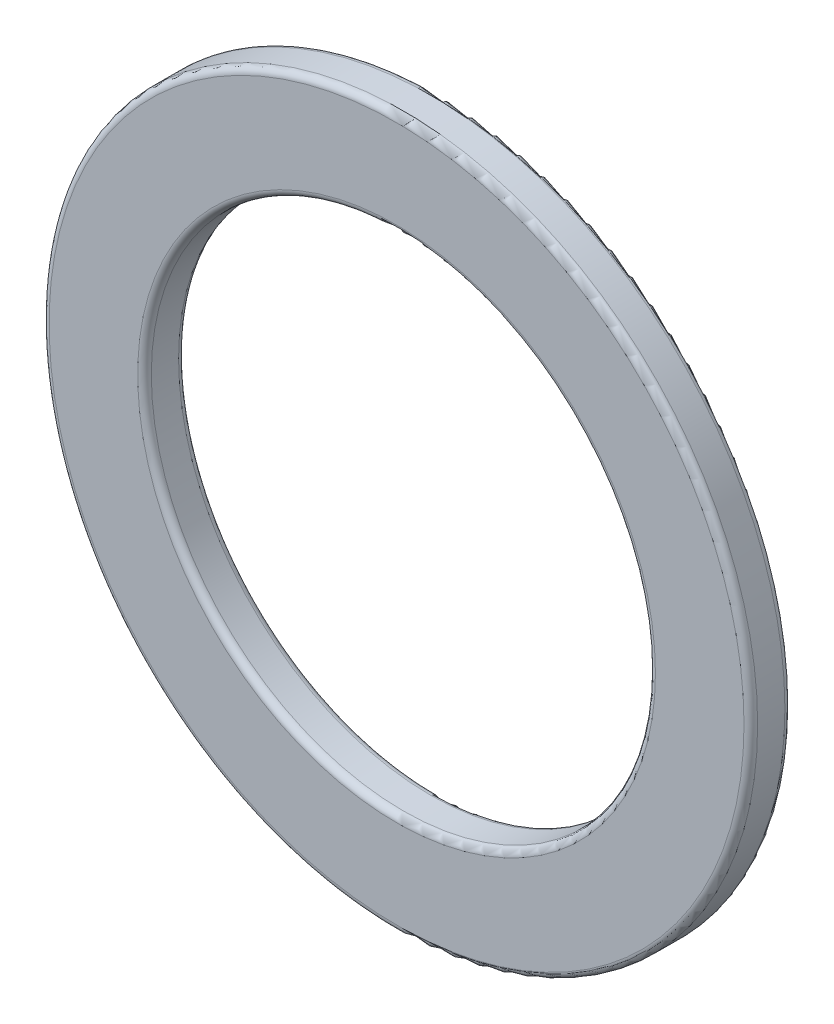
ISO-10303-21;
HEADER;
FILE_DESCRIPTION(('STEP AP214'),'2;1');
FILE_NAME('part.step','',(''),(''),'','','');
FILE_SCHEMA(('AUTOMOTIVE_DESIGN { 1 0 10303 214 1 1 1 1 }'));
ENDSEC;
DATA;
#1=APPLICATION_CONTEXT('core data for automotive mechanical design processes');
#2=APPLICATION_PROTOCOL_DEFINITION('international standard','automotive_design',2000,#1);
#3=PRODUCT_CONTEXT('',#1,'mechanical');
#4=PRODUCT('Part','Part','',(#3));
#5=PRODUCT_RELATED_PRODUCT_CATEGORY('part','',(#4));
#6=PRODUCT_DEFINITION_FORMATION('','',#4);
#7=PRODUCT_DEFINITION_CONTEXT('part definition',#1,'design');
#8=PRODUCT_DEFINITION('design','',#6,#7);
#9=PRODUCT_DEFINITION_SHAPE('','',#8);
#10=(LENGTH_UNIT() NAMED_UNIT(*) SI_UNIT(.MILLI.,.METRE.));
#11=(NAMED_UNIT(*) PLANE_ANGLE_UNIT() SI_UNIT($,.RADIAN.));
#12=(NAMED_UNIT(*) SI_UNIT($,.STERADIAN.) SOLID_ANGLE_UNIT());
#13=UNCERTAINTY_MEASURE_WITH_UNIT(LENGTH_MEASURE(1.E-05),#10,'distance_accuracy_value','');
#14=(GEOMETRIC_REPRESENTATION_CONTEXT(3) GLOBAL_UNCERTAINTY_ASSIGNED_CONTEXT((#13)) GLOBAL_UNIT_ASSIGNED_CONTEXT((#10,
#11,#12)) REPRESENTATION_CONTEXT('',''));
#15=CARTESIAN_POINT('',(0.,0.,0.));
#16=DIRECTION('',(0.,0.,1.));
#17=DIRECTION('',(1.,0.,0.));
#18=AXIS2_PLACEMENT_3D('',#15,#16,#17);
#19=CARTESIAN_POINT('',(0.,0.,3.));
#20=DIRECTION('',(0.,0.,1.));
#21=DIRECTION('',(1.,0.,0.));
#22=AXIS2_PLACEMENT_3D('',#19,#20,#21);
#23=PLANE('',#22);
#24=CARTESIAN_POINT('',(0.,0.,3.));
#25=DIRECTION('',(0.,0.,1.));
#26=DIRECTION('',(1.,0.,0.));
#27=AXIS2_PLACEMENT_3D('',#24,#25,#26);
#28=CIRCLE('',#27,25.5);
#29=CARTESIAN_POINT('',(25.5,0.,3.));
#30=VERTEX_POINT('',#29);
#31=EDGE_CURVE('E37',#30,#30,#28,.T.);
#32=ORIENTED_EDGE('',*,*,#31,.T.);
#33=EDGE_LOOP('',(#32));
#34=FACE_BOUND('',#33,.T.);
#35=CARTESIAN_POINT('',(0.,0.,3.));
#36=DIRECTION('',(0.,0.,1.));
#37=DIRECTION('',(1.,0.,0.));
#38=AXIS2_PLACEMENT_3D('',#35,#36,#37);
#39=CIRCLE('',#38,19.);
#40=CARTESIAN_POINT('',(19.,0.,3.));
#41=VERTEX_POINT('',#40);
#42=EDGE_CURVE('E41',#41,#41,#39,.F.);
#43=ORIENTED_EDGE('',*,*,#42,.T.);
#44=EDGE_LOOP('',(#43));
#45=FACE_BOUND('',#44,.T.);
#46=ADVANCED_FACE('F26',(#34,#45),#23,.T.);
#47=CARTESIAN_POINT('',(0.,0.,0.));
#48=DIRECTION('',(0.,0.,1.));
#49=DIRECTION('',(1.,0.,0.));
#50=AXIS2_PLACEMENT_3D('',#47,#48,#49);
#51=PLANE('',#50);
#52=CARTESIAN_POINT('',(0.,0.,0.));
#53=DIRECTION('',(0.,0.,1.));
#54=DIRECTION('',(1.,0.,0.));
#55=AXIS2_PLACEMENT_3D('',#52,#53,#54);
#56=CIRCLE('',#55,25.5);
#57=CARTESIAN_POINT('',(25.5,0.,0.));
#58=VERTEX_POINT('',#57);
#59=EDGE_CURVE('E46',#58,#58,#56,.F.);
#60=ORIENTED_EDGE('',*,*,#59,.T.);
#61=EDGE_LOOP('',(#60));
#62=FACE_BOUND('',#61,.T.);
#63=CARTESIAN_POINT('',(0.,0.,0.));
#64=DIRECTION('',(0.,0.,1.));
#65=DIRECTION('',(1.,0.,0.));
#66=AXIS2_PLACEMENT_3D('',#63,#64,#65);
#67=CIRCLE('',#66,19.);
#68=CARTESIAN_POINT('',(19.,0.,0.));
#69=VERTEX_POINT('',#68);
#70=EDGE_CURVE('E49',#69,#69,#67,.T.);
#71=ORIENTED_EDGE('',*,*,#70,.T.);
#72=EDGE_LOOP('',(#71));
#73=FACE_BOUND('',#72,.T.);
#74=ADVANCED_FACE('F70',(#62,#73),#51,.F.);
#75=CARTESIAN_POINT('',(0.,0.,3.));
#76=DIRECTION('',(0.,0.,-1.));
#77=DIRECTION('',(-1.,0.,0.));
#78=AXIS2_PLACEMENT_3D('',#75,#76,#77);
#79=CYLINDRICAL_SURFACE('',#78,26.);
#80=CARTESIAN_POINT('',(0.,0.,0.5));
#81=DIRECTION('',(0.,0.,1.));
#82=DIRECTION('',(1.,0.,0.));
#83=AXIS2_PLACEMENT_3D('',#80,#81,#82);
#84=CIRCLE('',#83,26.);
#85=CARTESIAN_POINT('',(26.,0.,0.5));
#86=VERTEX_POINT('',#85);
#87=EDGE_CURVE('E52',#86,#86,#84,.T.);
#88=ORIENTED_EDGE('',*,*,#87,.T.);
#89=EDGE_LOOP('',(#88));
#90=FACE_BOUND('',#89,.T.);
#91=CARTESIAN_POINT('',(0.,0.,2.5));
#92=DIRECTION('',(0.,0.,1.));
#93=DIRECTION('',(1.,0.,0.));
#94=AXIS2_PLACEMENT_3D('',#91,#92,#93);
#95=CIRCLE('',#94,26.);
#96=CARTESIAN_POINT('',(26.,0.,2.5));
#97=VERTEX_POINT('',#96);
#98=EDGE_CURVE('E55',#97,#97,#95,.F.);
#99=ORIENTED_EDGE('',*,*,#98,.T.);
#100=EDGE_LOOP('',(#99));
#101=FACE_BOUND('',#100,.T.);
#102=ADVANCED_FACE('F28',(#90,#101),#79,.T.);
#103=CARTESIAN_POINT('',(0.,0.,3.));
#104=DIRECTION('',(0.,0.,-1.));
#105=DIRECTION('',(-1.,0.,0.));
#106=AXIS2_PLACEMENT_3D('',#103,#104,#105);
#107=CYLINDRICAL_SURFACE('',#106,18.5);
#108=CARTESIAN_POINT('',(0.,0.,0.5));
#109=DIRECTION('',(0.,0.,1.));
#110=DIRECTION('',(1.,0.,0.));
#111=AXIS2_PLACEMENT_3D('',#108,#109,#110);
#112=CIRCLE('',#111,18.5);
#113=CARTESIAN_POINT('',(18.5,0.,0.5));
#114=VERTEX_POINT('',#113);
#115=EDGE_CURVE('E10',#114,#114,#112,.F.);
#116=ORIENTED_EDGE('',*,*,#115,.T.);
#117=EDGE_LOOP('',(#116));
#118=FACE_BOUND('',#117,.T.);
#119=CARTESIAN_POINT('',(0.,0.,2.5));
#120=DIRECTION('',(0.,0.,1.));
#121=DIRECTION('',(1.,0.,0.));
#122=AXIS2_PLACEMENT_3D('',#119,#120,#121);
#123=CIRCLE('',#122,18.5);
#124=CARTESIAN_POINT('',(18.5,0.,2.5));
#125=VERTEX_POINT('',#124);
#126=EDGE_CURVE('E33',#125,#125,#123,.T.);
#127=ORIENTED_EDGE('',*,*,#126,.T.);
#128=EDGE_LOOP('',(#127));
#129=FACE_BOUND('',#128,.T.);
#130=ADVANCED_FACE('F85',(#118,#129),#107,.F.);
#131=CARTESIAN_POINT('',(0.,0.,0.5));
#132=DIRECTION('',(0.,0.,1.));
#133=DIRECTION('',(1.,0.,0.));
#134=AXIS2_PLACEMENT_3D('',#131,#132,#133);
#135=TOROIDAL_SURFACE('',#134,25.5,0.5);
#136=ORIENTED_EDGE('',*,*,#59,.F.);
#137=EDGE_LOOP('',(#136));
#138=FACE_BOUND('',#137,.T.);
#139=ORIENTED_EDGE('',*,*,#87,.F.);
#140=EDGE_LOOP('',(#139));
#141=FACE_BOUND('',#140,.T.);
#142=ADVANCED_FACE('F64',(#138,#141),#135,.T.);
#143=CARTESIAN_POINT('',(0.,0.,2.5));
#144=DIRECTION('',(0.,0.,1.));
#145=DIRECTION('',(1.,0.,0.));
#146=AXIS2_PLACEMENT_3D('',#143,#144,#145);
#147=TOROIDAL_SURFACE('',#146,25.5,0.5);
#148=ORIENTED_EDGE('',*,*,#98,.F.);
#149=EDGE_LOOP('',(#148));
#150=FACE_BOUND('',#149,.T.);
#151=ORIENTED_EDGE('',*,*,#31,.F.);
#152=EDGE_LOOP('',(#151));
#153=FACE_BOUND('',#152,.T.);
#154=ADVANCED_FACE('F60',(#150,#153),#147,.T.);
#155=CARTESIAN_POINT('',(0.,0.,0.5));
#156=DIRECTION('',(0.,0.,1.));
#157=DIRECTION('',(1.,0.,0.));
#158=AXIS2_PLACEMENT_3D('',#155,#156,#157);
#159=TOROIDAL_SURFACE('',#158,19.,0.5);
#160=ORIENTED_EDGE('',*,*,#115,.F.);
#161=EDGE_LOOP('',(#160));
#162=FACE_BOUND('',#161,.T.);
#163=ORIENTED_EDGE('',*,*,#70,.F.);
#164=EDGE_LOOP('',(#163));
#165=FACE_BOUND('',#164,.T.);
#166=ADVANCED_FACE('F63',(#162,#165),#159,.T.);
#167=CARTESIAN_POINT('',(0.,0.,2.5));
#168=DIRECTION('',(0.,0.,1.));
#169=DIRECTION('',(1.,0.,0.));
#170=AXIS2_PLACEMENT_3D('',#167,#168,#169);
#171=TOROIDAL_SURFACE('',#170,19.,0.5);
#172=ORIENTED_EDGE('',*,*,#42,.F.);
#173=EDGE_LOOP('',(#172));
#174=FACE_BOUND('',#173,.T.);
#175=ORIENTED_EDGE('',*,*,#126,.F.);
#176=EDGE_LOOP('',(#175));
#177=FACE_BOUND('',#176,.T.);
#178=ADVANCED_FACE('F73',(#174,#177),#171,.T.);
#179=CLOSED_SHELL('',(#46,#74,#102,#130,#142,#154,#166,#178));
#180=MANIFOLD_SOLID_BREP('B2',#179);
#181=ADVANCED_BREP_SHAPE_REPRESENTATION('',(#18,#180),#14);
#182=SHAPE_DEFINITION_REPRESENTATION(#9,#181);
ENDSEC;
END-ISO-10303-21;
